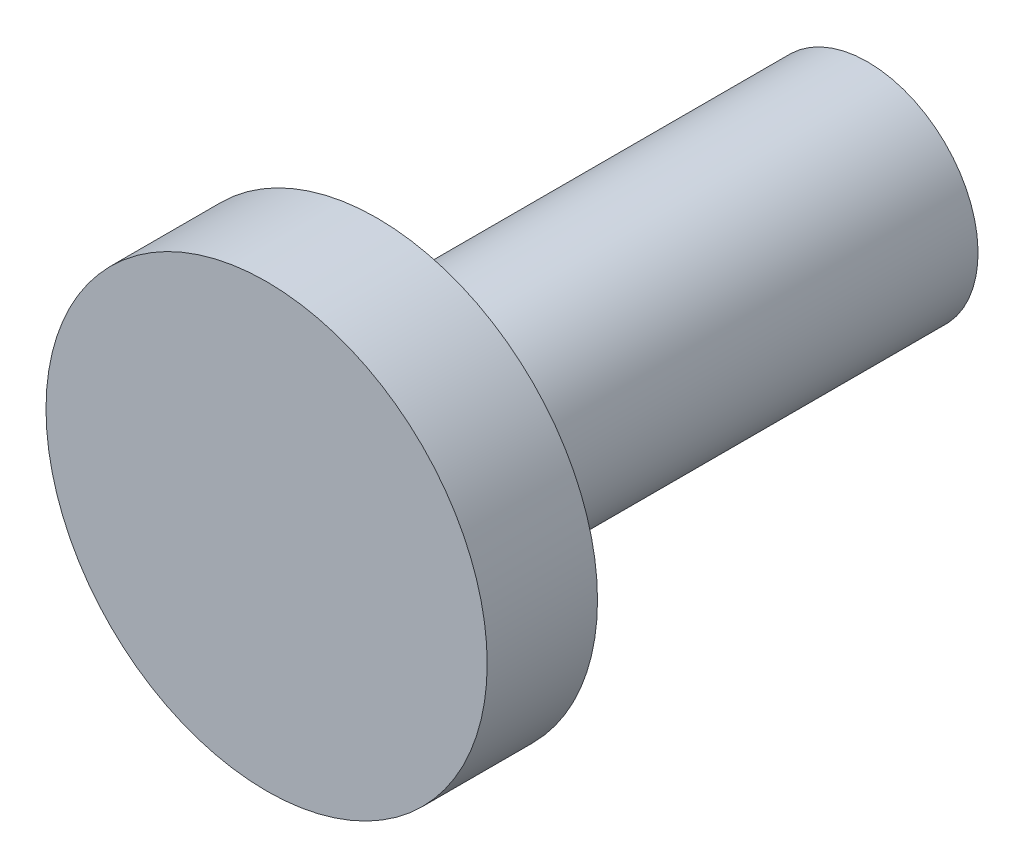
ISO-10303-21;
HEADER;
FILE_DESCRIPTION(('STEP AP214'),'2;1');
FILE_NAME('part.step','',(''),(''),'','','');
FILE_SCHEMA(('AUTOMOTIVE_DESIGN { 1 0 10303 214 1 1 1 1 }'));
ENDSEC;
DATA;
#1=APPLICATION_CONTEXT('core data for automotive mechanical design processes');
#2=APPLICATION_PROTOCOL_DEFINITION('international standard','automotive_design',2000,#1);
#3=PRODUCT_CONTEXT('',#1,'mechanical');
#4=PRODUCT('Part','Part','',(#3));
#5=PRODUCT_RELATED_PRODUCT_CATEGORY('part','',(#4));
#6=PRODUCT_DEFINITION_FORMATION('','',#4);
#7=PRODUCT_DEFINITION_CONTEXT('part definition',#1,'design');
#8=PRODUCT_DEFINITION('design','',#6,#7);
#9=PRODUCT_DEFINITION_SHAPE('','',#8);
#10=(LENGTH_UNIT() NAMED_UNIT(*) SI_UNIT(.MILLI.,.METRE.));
#11=(NAMED_UNIT(*) PLANE_ANGLE_UNIT() SI_UNIT($,.RADIAN.));
#12=(NAMED_UNIT(*) SI_UNIT($,.STERADIAN.) SOLID_ANGLE_UNIT());
#13=UNCERTAINTY_MEASURE_WITH_UNIT(LENGTH_MEASURE(1.E-05),#10,'distance_accuracy_value','');
#14=(GEOMETRIC_REPRESENTATION_CONTEXT(3) GLOBAL_UNCERTAINTY_ASSIGNED_CONTEXT((#13)) GLOBAL_UNIT_ASSIGNED_CONTEXT((#10,
#11,#12)) REPRESENTATION_CONTEXT('',''));
#15=CARTESIAN_POINT('',(0.,0.,0.));
#16=DIRECTION('',(0.,0.,1.));
#17=DIRECTION('',(1.,0.,0.));
#18=AXIS2_PLACEMENT_3D('',#15,#16,#17);
#19=CARTESIAN_POINT('',(0.,0.,-44.5));
#20=DIRECTION('',(0.,0.,-1.));
#21=DIRECTION('',(0.,1.,0.));
#22=AXIS2_PLACEMENT_3D('',#19,#20,#21);
#23=PLANE('',#22);
#24=CARTESIAN_POINT('',(0.,0.,-44.5));
#25=DIRECTION('',(0.,0.,-1.));
#26=DIRECTION('',(0.,1.,0.));
#27=AXIS2_PLACEMENT_3D('',#24,#25,#26);
#28=CIRCLE('',#27,10.);
#29=CARTESIAN_POINT('',(0.,10.,-44.5));
#30=VERTEX_POINT('',#29);
#31=EDGE_CURVE('E8',#30,#30,#28,.T.);
#32=ORIENTED_EDGE('',*,*,#31,.T.);
#33=EDGE_LOOP('',(#32));
#34=FACE_BOUND('',#33,.T.);
#35=ADVANCED_FACE('F12',(#34),#23,.T.);
#36=CARTESIAN_POINT('',(0.,0.,-54.5));
#37=DIRECTION('',(0.,0.,-1.));
#38=DIRECTION('',(0.,1.,0.));
#39=AXIS2_PLACEMENT_3D('',#36,#37,#38);
#40=CYLINDRICAL_SURFACE('',#39,10.);
#41=CARTESIAN_POINT('',(0.,0.,0.));
#42=DIRECTION('',(0.,0.,-1.));
#43=DIRECTION('',(0.,1.,0.));
#44=AXIS2_PLACEMENT_3D('',#41,#42,#43);
#45=CIRCLE('',#44,10.);
#46=CARTESIAN_POINT('',(0.,10.,0.));
#47=VERTEX_POINT('',#46);
#48=EDGE_CURVE('E18',#47,#47,#45,.T.);
#49=ORIENTED_EDGE('',*,*,#48,.T.);
#50=EDGE_LOOP('',(#49));
#51=FACE_BOUND('',#50,.T.);
#52=ORIENTED_EDGE('',*,*,#31,.F.);
#53=EDGE_LOOP('',(#52));
#54=FACE_BOUND('',#53,.T.);
#55=ADVANCED_FACE('F45',(#51,#54),#40,.T.);
#56=CARTESIAN_POINT('',(10.,0.,0.));
#57=DIRECTION('',(0.,0.,-1.));
#58=DIRECTION('',(0.,1.,0.));
#59=AXIS2_PLACEMENT_3D('',#56,#57,#58);
#60=PLANE('',#59);
#61=CARTESIAN_POINT('',(0.,0.,0.));
#62=DIRECTION('',(0.,0.,-1.));
#63=DIRECTION('',(0.,1.,0.));
#64=AXIS2_PLACEMENT_3D('',#61,#62,#63);
#65=CIRCLE('',#64,20.);
#66=CARTESIAN_POINT('',(0.,20.,0.));
#67=VERTEX_POINT('',#66);
#68=EDGE_CURVE('E22',#67,#67,#65,.T.);
#69=ORIENTED_EDGE('',*,*,#68,.T.);
#70=EDGE_LOOP('',(#69));
#71=FACE_BOUND('',#70,.T.);
#72=ORIENTED_EDGE('',*,*,#48,.F.);
#73=EDGE_LOOP('',(#72));
#74=FACE_BOUND('',#73,.T.);
#75=ADVANCED_FACE('F42',(#71,#74),#60,.T.);
#76=CARTESIAN_POINT('',(0.,0.,-54.5));
#77=DIRECTION('',(0.,0.,-1.));
#78=DIRECTION('',(0.,1.,0.));
#79=AXIS2_PLACEMENT_3D('',#76,#77,#78);
#80=CYLINDRICAL_SURFACE('',#79,20.);
#81=CARTESIAN_POINT('',(0.,0.,10.));
#82=DIRECTION('',(0.,0.,-1.));
#83=DIRECTION('',(0.,1.,0.));
#84=AXIS2_PLACEMENT_3D('',#81,#82,#83);
#85=CIRCLE('',#84,20.);
#86=CARTESIAN_POINT('',(0.,20.,10.));
#87=VERTEX_POINT('',#86);
#88=EDGE_CURVE('E26',#87,#87,#85,.T.);
#89=ORIENTED_EDGE('',*,*,#88,.T.);
#90=EDGE_LOOP('',(#89));
#91=FACE_BOUND('',#90,.T.);
#92=ORIENTED_EDGE('',*,*,#68,.F.);
#93=EDGE_LOOP('',(#92));
#94=FACE_BOUND('',#93,.T.);
#95=ADVANCED_FACE('F32',(#91,#94),#80,.T.);
#96=CARTESIAN_POINT('',(20.,0.,10.));
#97=DIRECTION('',(0.,0.,1.));
#98=DIRECTION('',(0.,-1.,0.));
#99=AXIS2_PLACEMENT_3D('',#96,#97,#98);
#100=PLANE('',#99);
#101=ORIENTED_EDGE('',*,*,#88,.F.);
#102=EDGE_LOOP('',(#101));
#103=FACE_BOUND('',#102,.T.);
#104=ADVANCED_FACE('F35',(#103),#100,.T.);
#105=CLOSED_SHELL('',(#35,#55,#75,#95,#104));
#106=MANIFOLD_SOLID_BREP('B1',#105);
#107=ADVANCED_BREP_SHAPE_REPRESENTATION('',(#18,#106),#14);
#108=SHAPE_DEFINITION_REPRESENTATION(#9,#107);
ENDSEC;
END-ISO-10303-21;
